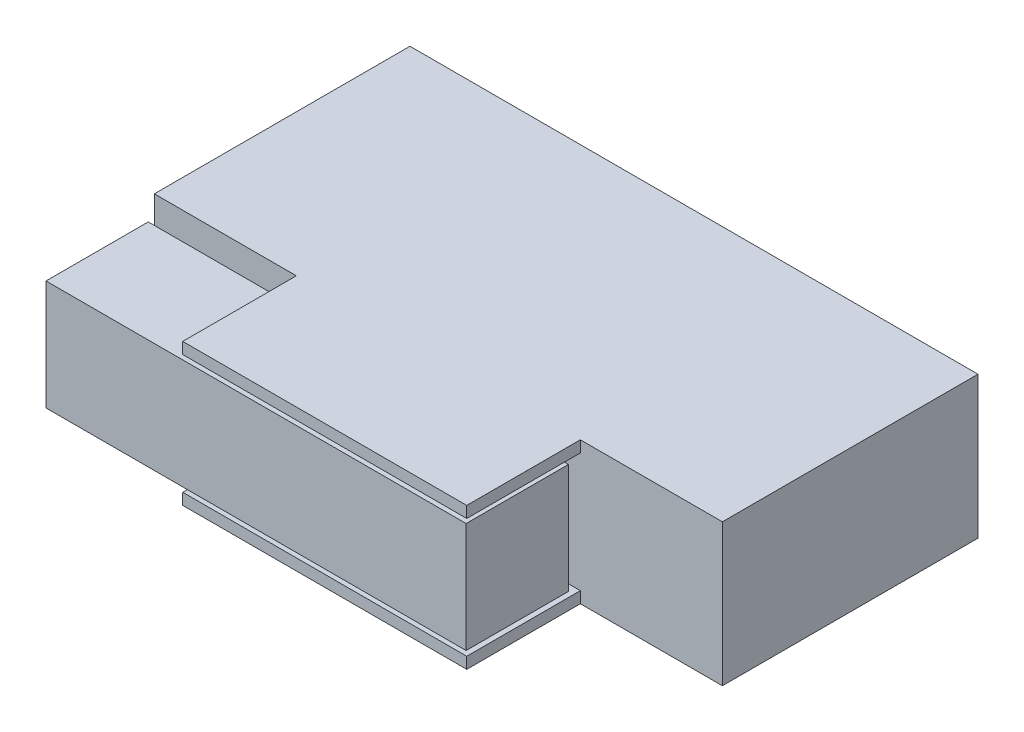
ISO-10303-21;
HEADER;
FILE_DESCRIPTION(('STEP AP214'),'2;1');
FILE_NAME('part.step','',(''),(''),'','','');
FILE_SCHEMA(('AUTOMOTIVE_DESIGN { 1 0 10303 214 1 1 1 1 }'));
ENDSEC;
DATA;
#1=APPLICATION_CONTEXT('core data for automotive mechanical design processes');
#2=APPLICATION_PROTOCOL_DEFINITION('international standard','automotive_design',2000,#1);
#3=PRODUCT_CONTEXT('',#1,'mechanical');
#4=PRODUCT('Part','Part','',(#3));
#5=PRODUCT_RELATED_PRODUCT_CATEGORY('part','',(#4));
#6=PRODUCT_DEFINITION_FORMATION('','',#4);
#7=PRODUCT_DEFINITION_CONTEXT('part definition',#1,'design');
#8=PRODUCT_DEFINITION('design','',#6,#7);
#9=PRODUCT_DEFINITION_SHAPE('','',#8);
#10=(LENGTH_UNIT() NAMED_UNIT(*) SI_UNIT(.MILLI.,.METRE.));
#11=(NAMED_UNIT(*) PLANE_ANGLE_UNIT() SI_UNIT($,.RADIAN.));
#12=(NAMED_UNIT(*) SI_UNIT($,.STERADIAN.) SOLID_ANGLE_UNIT());
#13=UNCERTAINTY_MEASURE_WITH_UNIT(LENGTH_MEASURE(1.E-05),#10,'distance_accuracy_value','');
#14=(GEOMETRIC_REPRESENTATION_CONTEXT(3) GLOBAL_UNCERTAINTY_ASSIGNED_CONTEXT((#13)) GLOBAL_UNIT_ASSIGNED_CONTEXT((#10,
#11,#12)) REPRESENTATION_CONTEXT('',''));
#15=CARTESIAN_POINT('',(0.,0.,0.));
#16=DIRECTION('',(0.,0.,1.));
#17=DIRECTION('',(1.,0.,0.));
#18=AXIS2_PLACEMENT_3D('',#15,#16,#17);
#19=CARTESIAN_POINT('',(7.4889779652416,2.21823977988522,4.7));
#20=DIRECTION('',(1.,0.,0.));
#21=DIRECTION('',(0.,0.,-1.));
#22=AXIS2_PLACEMENT_3D('',#19,#20,#21);
#23=PLANE('',#22);
#24=DIRECTION('',(0.,1.,0.));
#25=VECTOR('',#24,1.);
#26=CARTESIAN_POINT('',(7.4889779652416,2.21823977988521,6.5));
#27=LINE('',#26,#25);
#28=CARTESIAN_POINT('',(7.4889779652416,0.281760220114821,6.5));
#29=VERTEX_POINT('',#28);
#30=CARTESIAN_POINT('',(7.4889779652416,2.21823977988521,6.5));
#31=VERTEX_POINT('',#30);
#32=EDGE_CURVE('E108',#29,#31,#27,.T.);
#33=ORIENTED_EDGE('',*,*,#32,.F.);
#34=DIRECTION('',(0.,0.,1.));
#35=VECTOR('',#34,1.);
#36=CARTESIAN_POINT('',(7.4889779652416,0.281760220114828,4.69999999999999));
#37=LINE('',#36,#35);
#38=CARTESIAN_POINT('',(7.4889779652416,0.281760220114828,4.69999999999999));
#39=VERTEX_POINT('',#38);
#40=EDGE_CURVE('E12',#39,#29,#37,.T.);
#41=ORIENTED_EDGE('',*,*,#40,.F.);
#42=DIRECTION('',(0.,1.,0.));
#43=VECTOR('',#42,1.);
#44=CARTESIAN_POINT('',(7.4889779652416,2.21823977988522,4.7));
#45=LINE('',#44,#43);
#46=CARTESIAN_POINT('',(7.4889779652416,2.21823977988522,4.7));
#47=VERTEX_POINT('',#46);
#48=EDGE_CURVE('E102',#39,#47,#45,.T.);
#49=ORIENTED_EDGE('',*,*,#48,.T.);
#50=DIRECTION('',(0.,0.,1.));
#51=VECTOR('',#50,1.);
#52=CARTESIAN_POINT('',(7.4889779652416,2.21823977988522,4.7));
#53=LINE('',#52,#51);
#54=EDGE_CURVE('E47',#47,#31,#53,.T.);
#55=ORIENTED_EDGE('',*,*,#54,.T.);
#56=EDGE_LOOP('',(#33,#41,#49,#55));
#57=FACE_BOUND('',#56,.T.);
#58=ADVANCED_FACE('F44',(#57),#23,.T.);
#59=CARTESIAN_POINT('',(7.4889779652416,0.281760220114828,4.69999999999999));
#60=DIRECTION('',(0.,-1.,0.));
#61=DIRECTION('',(0.,0.,-1.));
#62=AXIS2_PLACEMENT_3D('',#59,#60,#61);
#63=PLANE('',#62);
#64=DIRECTION('',(1.,0.,0.));
#65=VECTOR('',#64,1.);
#66=CARTESIAN_POINT('',(7.4889779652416,0.281760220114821,6.5));
#67=LINE('',#66,#65);
#68=CARTESIAN_POINT('',(0.0931577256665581,0.281760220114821,6.5));
#69=VERTEX_POINT('',#68);
#70=EDGE_CURVE('E104',#69,#29,#67,.T.);
#71=ORIENTED_EDGE('',*,*,#70,.F.);
#72=DIRECTION('',(0.,0.,1.));
#73=VECTOR('',#72,1.);
#74=CARTESIAN_POINT('',(0.0931577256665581,0.281760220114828,4.69999999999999));
#75=LINE('',#74,#73);
#76=CARTESIAN_POINT('',(0.0931577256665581,0.281760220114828,4.69999999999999));
#77=VERTEX_POINT('',#76);
#78=EDGE_CURVE('E53',#77,#69,#75,.T.);
#79=ORIENTED_EDGE('',*,*,#78,.F.);
#80=DIRECTION('',(1.,0.,0.));
#81=VECTOR('',#80,1.);
#82=CARTESIAN_POINT('',(7.4889779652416,0.281760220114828,4.69999999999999));
#83=LINE('',#82,#81);
#84=EDGE_CURVE('E99',#77,#39,#83,.T.);
#85=ORIENTED_EDGE('',*,*,#84,.T.);
#86=ORIENTED_EDGE('',*,*,#40,.T.);
#87=EDGE_LOOP('',(#71,#79,#85,#86));
#88=FACE_BOUND('',#87,.T.);
#89=ADVANCED_FACE('F118',(#88),#63,.T.);
#90=CARTESIAN_POINT('',(0.0931577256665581,2.21823977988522,4.7));
#91=DIRECTION('',(-1.,0.,0.));
#92=DIRECTION('',(0.,0.,1.));
#93=AXIS2_PLACEMENT_3D('',#90,#91,#92);
#94=PLANE('',#93);
#95=DIRECTION('',(0.,-1.,0.));
#96=VECTOR('',#95,1.);
#97=CARTESIAN_POINT('',(0.0931577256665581,2.21823977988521,6.5));
#98=LINE('',#97,#96);
#99=CARTESIAN_POINT('',(0.0931577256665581,2.21823977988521,6.5));
#100=VERTEX_POINT('',#99);
#101=EDGE_CURVE('E94',#100,#69,#98,.T.);
#102=ORIENTED_EDGE('',*,*,#101,.F.);
#103=DIRECTION('',(0.,0.,1.));
#104=VECTOR('',#103,1.);
#105=CARTESIAN_POINT('',(0.0931577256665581,2.21823977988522,4.7));
#106=LINE('',#105,#104);
#107=CARTESIAN_POINT('',(0.0931577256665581,2.21823977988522,4.7));
#108=VERTEX_POINT('',#107);
#109=EDGE_CURVE('E89',#108,#100,#106,.T.);
#110=ORIENTED_EDGE('',*,*,#109,.F.);
#111=DIRECTION('',(0.,-1.,0.));
#112=VECTOR('',#111,1.);
#113=CARTESIAN_POINT('',(0.0931577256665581,2.21823977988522,4.7));
#114=LINE('',#113,#112);
#115=EDGE_CURVE('E92',#108,#77,#114,.T.);
#116=ORIENTED_EDGE('',*,*,#115,.T.);
#117=ORIENTED_EDGE('',*,*,#78,.T.);
#118=EDGE_LOOP('',(#102,#110,#116,#117));
#119=FACE_BOUND('',#118,.T.);
#120=ADVANCED_FACE('F91',(#119),#94,.T.);
#121=CARTESIAN_POINT('',(7.4889779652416,2.21823977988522,4.7));
#122=DIRECTION('',(0.,1.,0.));
#123=DIRECTION('',(0.,0.,1.));
#124=AXIS2_PLACEMENT_3D('',#121,#122,#123);
#125=PLANE('',#124);
#126=DIRECTION('',(-1.,0.,0.));
#127=VECTOR('',#126,1.);
#128=CARTESIAN_POINT('',(7.4889779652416,2.21823977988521,6.5));
#129=LINE('',#128,#127);
#130=EDGE_CURVE('E111',#31,#100,#129,.T.);
#131=ORIENTED_EDGE('',*,*,#130,.F.);
#132=ORIENTED_EDGE('',*,*,#54,.F.);
#133=DIRECTION('',(-1.,0.,0.));
#134=VECTOR('',#133,1.);
#135=CARTESIAN_POINT('',(7.4889779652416,2.21823977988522,4.7));
#136=LINE('',#135,#134);
#137=EDGE_CURVE('E98',#47,#108,#136,.T.);
#138=ORIENTED_EDGE('',*,*,#137,.T.);
#139=ORIENTED_EDGE('',*,*,#109,.T.);
#140=EDGE_LOOP('',(#131,#132,#138,#139));
#141=FACE_BOUND('',#140,.T.);
#142=ADVANCED_FACE('F101',(#141),#125,.T.);
#143=CARTESIAN_POINT('',(7.4889779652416,0.281760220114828,4.69999999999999));
#144=DIRECTION('',(0.,0.,-1.));
#145=DIRECTION('',(-1.,0.,0.));
#146=AXIS2_PLACEMENT_3D('',#143,#144,#145);
#147=PLANE('',#146);
#148=ORIENTED_EDGE('',*,*,#48,.F.);
#149=ORIENTED_EDGE('',*,*,#84,.F.);
#150=ORIENTED_EDGE('',*,*,#115,.F.);
#151=ORIENTED_EDGE('',*,*,#137,.F.);
#152=EDGE_LOOP('',(#148,#149,#150,#151));
#153=FACE_BOUND('',#152,.T.);
#154=ADVANCED_FACE('F97',(#153),#147,.T.);
#155=CARTESIAN_POINT('',(7.4889779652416,0.281760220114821,6.5));
#156=DIRECTION('',(0.,0.,-1.));
#157=DIRECTION('',(-1.,0.,0.));
#158=AXIS2_PLACEMENT_3D('',#155,#156,#157);
#159=PLANE('',#158);
#160=ORIENTED_EDGE('',*,*,#32,.T.);
#161=ORIENTED_EDGE('',*,*,#130,.T.);
#162=ORIENTED_EDGE('',*,*,#101,.T.);
#163=ORIENTED_EDGE('',*,*,#70,.T.);
#164=EDGE_LOOP('',(#160,#161,#162,#163));
#165=FACE_BOUND('',#164,.T.);
#166=ADVANCED_FACE('F117',(#165),#159,.F.);
#167=CLOSED_SHELL('',(#58,#89,#120,#142,#154,#166));
#168=MANIFOLD_SOLID_BREP('B2',#167);
#169=CARTESIAN_POINT('',(0.,2.49999999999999,6.5));
#170=DIRECTION('',(0.,0.,-1.));
#171=DIRECTION('',(-1.,0.,0.));
#172=AXIS2_PLACEMENT_3D('',#169,#170,#171);
#173=PLANE('',#172);
#174=DIRECTION('',(1.,0.,0.));
#175=VECTOR('',#174,1.);
#176=CARTESIAN_POINT('',(0.,0.,6.5));
#177=LINE('',#176,#175);
#178=CARTESIAN_POINT('',(2.5,0.,6.5));
#179=VERTEX_POINT('',#178);
#180=CARTESIAN_POINT('',(7.5,0.,6.5));
#181=VERTEX_POINT('',#180);
#182=EDGE_CURVE('E338',#179,#181,#177,.T.);
#183=ORIENTED_EDGE('',*,*,#182,.T.);
#184=DIRECTION('',(0.,-1.,0.));
#185=VECTOR('',#184,1.);
#186=CARTESIAN_POINT('',(7.5,0.199999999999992,6.5));
#187=LINE('',#186,#185);
#188=CARTESIAN_POINT('',(7.5,0.199999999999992,6.5));
#189=VERTEX_POINT('',#188);
#190=EDGE_CURVE('E266',#189,#181,#187,.T.);
#191=ORIENTED_EDGE('',*,*,#190,.F.);
#192=DIRECTION('',(1.,0.,0.));
#193=VECTOR('',#192,1.);
#194=CARTESIAN_POINT('',(2.5,0.199999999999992,6.5));
#195=LINE('',#194,#193);
#196=CARTESIAN_POINT('',(2.5,0.199999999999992,6.5));
#197=VERTEX_POINT('',#196);
#198=EDGE_CURVE('E279',#197,#189,#195,.T.);
#199=ORIENTED_EDGE('',*,*,#198,.F.);
#200=DIRECTION('',(0.,1.,0.));
#201=VECTOR('',#200,1.);
#202=CARTESIAN_POINT('',(2.5,0.,6.5));
#203=LINE('',#202,#201);
#204=EDGE_CURVE('E318',#179,#197,#203,.T.);
#205=ORIENTED_EDGE('',*,*,#204,.F.);
#206=EDGE_LOOP('',(#183,#191,#199,#205));
#207=FACE_BOUND('',#206,.T.);
#208=ADVANCED_FACE('F169',(#207),#173,.F.);
#209=CARTESIAN_POINT('',(0.,0.,6.5));
#210=DIRECTION('',(1.,0.,0.));
#211=DIRECTION('',(0.,0.,-1.));
#212=AXIS2_PLACEMENT_3D('',#209,#210,#211);
#213=PLANE('',#212);
#214=DIRECTION('',(0.,0.,-1.));
#215=VECTOR('',#214,1.);
#216=CARTESIAN_POINT('',(0.,0.,6.5));
#217=LINE('',#216,#215);
#218=CARTESIAN_POINT('',(0.,0.,4.5));
#219=VERTEX_POINT('',#218);
#220=CARTESIAN_POINT('',(0.,0.,0.));
#221=VERTEX_POINT('',#220);
#222=EDGE_CURVE('E42',#219,#221,#217,.T.);
#223=ORIENTED_EDGE('',*,*,#222,.F.);
#224=DIRECTION('',(0.,-1.,0.));
#225=VECTOR('',#224,1.);
#226=CARTESIAN_POINT('',(0.,2.5,4.5));
#227=LINE('',#226,#225);
#228=CARTESIAN_POINT('',(0.,2.5,4.5));
#229=VERTEX_POINT('',#228);
#230=EDGE_CURVE('E302',#229,#219,#227,.T.);
#231=ORIENTED_EDGE('',*,*,#230,.F.);
#232=DIRECTION('',(0.,0.,-1.));
#233=VECTOR('',#232,1.);
#234=CARTESIAN_POINT('',(0.,2.49999999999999,6.5));
#235=LINE('',#234,#233);
#236=CARTESIAN_POINT('',(0.,2.5,0.));
#237=VERTEX_POINT('',#236);
#238=EDGE_CURVE('E192',#229,#237,#235,.T.);
#239=ORIENTED_EDGE('',*,*,#238,.T.);
#240=DIRECTION('',(0.,-1.,0.));
#241=VECTOR('',#240,1.);
#242=CARTESIAN_POINT('',(0.,0.,0.));
#243=LINE('',#242,#241);
#244=EDGE_CURVE('E325',#237,#221,#243,.T.);
#245=ORIENTED_EDGE('',*,*,#244,.T.);
#246=EDGE_LOOP('',(#223,#231,#239,#245));
#247=FACE_BOUND('',#246,.T.);
#248=ADVANCED_FACE('F171',(#247),#213,.F.);
#249=CARTESIAN_POINT('',(0.,0.,6.5));
#250=DIRECTION('',(0.,1.,0.));
#251=DIRECTION('',(0.,0.,1.));
#252=AXIS2_PLACEMENT_3D('',#249,#250,#251);
#253=PLANE('',#252);
#254=DIRECTION('',(1.,0.,0.));
#255=VECTOR('',#254,1.);
#256=CARTESIAN_POINT('',(10.,0.,4.5));
#257=LINE('',#256,#255);
#258=CARTESIAN_POINT('',(7.5,0.,4.5));
#259=VERTEX_POINT('',#258);
#260=CARTESIAN_POINT('',(10.,0.,4.5));
#261=VERTEX_POINT('',#260);
#262=EDGE_CURVE('E275',#259,#261,#257,.T.);
#263=ORIENTED_EDGE('',*,*,#262,.F.);
#264=DIRECTION('',(0.,0.,1.));
#265=VECTOR('',#264,1.);
#266=CARTESIAN_POINT('',(7.5,0.,4.5));
#267=LINE('',#266,#265);
#268=EDGE_CURVE('E260',#259,#181,#267,.T.);
#269=ORIENTED_EDGE('',*,*,#268,.T.);
#270=ORIENTED_EDGE('',*,*,#182,.F.);
#271=DIRECTION('',(0.,0.,1.));
#272=VECTOR('',#271,1.);
#273=CARTESIAN_POINT('',(2.5,0.,4.5));
#274=LINE('',#273,#272);
#275=CARTESIAN_POINT('',(2.5,0.,4.5));
#276=VERTEX_POINT('',#275);
#277=EDGE_CURVE('E328',#276,#179,#274,.T.);
#278=ORIENTED_EDGE('',*,*,#277,.F.);
#279=DIRECTION('',(1.,0.,0.));
#280=VECTOR('',#279,1.);
#281=CARTESIAN_POINT('',(0.,0.,4.5));
#282=LINE('',#281,#280);
#283=EDGE_CURVE('E304',#219,#276,#282,.T.);
#284=ORIENTED_EDGE('',*,*,#283,.F.);
#285=ORIENTED_EDGE('',*,*,#222,.T.);
#286=DIRECTION('',(1.,0.,0.));
#287=VECTOR('',#286,1.);
#288=CARTESIAN_POINT('',(0.,0.,0.));
#289=LINE('',#288,#287);
#290=CARTESIAN_POINT('',(10.,0.,0.));
#291=VERTEX_POINT('',#290);
#292=EDGE_CURVE('E345',#221,#291,#289,.T.);
#293=ORIENTED_EDGE('',*,*,#292,.T.);
#294=DIRECTION('',(0.,0.,-1.));
#295=VECTOR('',#294,1.);
#296=CARTESIAN_POINT('',(10.,0.,6.5));
#297=LINE('',#296,#295);
#298=EDGE_CURVE('E177',#261,#291,#297,.T.);
#299=ORIENTED_EDGE('',*,*,#298,.F.);
#300=EDGE_LOOP('',(#263,#269,#270,#278,#284,#285,#293,#299));
#301=FACE_BOUND('',#300,.T.);
#302=ADVANCED_FACE('F282',(#301),#253,.F.);
#303=CARTESIAN_POINT('',(10.,0.,6.5));
#304=DIRECTION('',(-1.,0.,0.));
#305=DIRECTION('',(0.,0.,1.));
#306=AXIS2_PLACEMENT_3D('',#303,#304,#305);
#307=PLANE('',#306);
#308=DIRECTION('',(0.,0.,-1.));
#309=VECTOR('',#308,1.);
#310=CARTESIAN_POINT('',(10.,2.5,6.5));
#311=LINE('',#310,#309);
#312=CARTESIAN_POINT('',(10.,2.5,4.5));
#313=VERTEX_POINT('',#312);
#314=CARTESIAN_POINT('',(10.,2.50000000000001,0.));
#315=VERTEX_POINT('',#314);
#316=EDGE_CURVE('E352',#313,#315,#311,.T.);
#317=ORIENTED_EDGE('',*,*,#316,.F.);
#318=DIRECTION('',(0.,1.,0.));
#319=VECTOR('',#318,1.);
#320=CARTESIAN_POINT('',(10.,2.5,4.5));
#321=LINE('',#320,#319);
#322=EDGE_CURVE('E284',#261,#313,#321,.T.);
#323=ORIENTED_EDGE('',*,*,#322,.F.);
#324=ORIENTED_EDGE('',*,*,#298,.T.);
#325=DIRECTION('',(0.,1.,0.));
#326=VECTOR('',#325,1.);
#327=CARTESIAN_POINT('',(10.,0.,0.));
#328=LINE('',#327,#326);
#329=EDGE_CURVE('E347',#291,#315,#328,.T.);
#330=ORIENTED_EDGE('',*,*,#329,.T.);
#331=EDGE_LOOP('',(#317,#323,#324,#330));
#332=FACE_BOUND('',#331,.T.);
#333=ADVANCED_FACE('F355',(#332),#307,.F.);
#334=CARTESIAN_POINT('',(0.,2.49999999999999,6.5));
#335=DIRECTION('',(0.,-1.,0.));
#336=DIRECTION('',(0.,0.,-1.));
#337=AXIS2_PLACEMENT_3D('',#334,#335,#336);
#338=PLANE('',#337);
#339=DIRECTION('',(-1.,0.,0.));
#340=VECTOR('',#339,1.);
#341=CARTESIAN_POINT('',(2.5,2.49999999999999,4.5));
#342=LINE('',#341,#340);
#343=CARTESIAN_POINT('',(2.5,2.49999999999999,4.5));
#344=VERTEX_POINT('',#343);
#345=EDGE_CURVE('E300',#344,#229,#342,.T.);
#346=ORIENTED_EDGE('',*,*,#345,.F.);
#347=DIRECTION('',(0.,0.,1.));
#348=VECTOR('',#347,1.);
#349=CARTESIAN_POINT('',(2.5,2.49999999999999,4.5));
#350=LINE('',#349,#348);
#351=CARTESIAN_POINT('',(2.5,2.49999999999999,6.5));
#352=VERTEX_POINT('',#351);
#353=EDGE_CURVE('E330',#344,#352,#350,.T.);
#354=ORIENTED_EDGE('',*,*,#353,.T.);
#355=DIRECTION('',(-1.,0.,0.));
#356=VECTOR('',#355,1.);
#357=CARTESIAN_POINT('',(0.,2.49999999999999,6.5));
#358=LINE('',#357,#356);
#359=CARTESIAN_POINT('',(7.5,2.49999999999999,6.5));
#360=VERTEX_POINT('',#359);
#361=EDGE_CURVE('E340',#360,#352,#358,.T.);
#362=ORIENTED_EDGE('',*,*,#361,.F.);
#363=DIRECTION('',(0.,0.,1.));
#364=VECTOR('',#363,1.);
#365=CARTESIAN_POINT('',(7.5,2.49999999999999,4.5));
#366=LINE('',#365,#364);
#367=CARTESIAN_POINT('',(7.5,2.49999999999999,4.5));
#368=VERTEX_POINT('',#367);
#369=EDGE_CURVE('E184',#368,#360,#366,.T.);
#370=ORIENTED_EDGE('',*,*,#369,.F.);
#371=DIRECTION('',(-1.,0.,0.));
#372=VECTOR('',#371,1.);
#373=CARTESIAN_POINT('',(7.5,2.49999999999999,4.5));
#374=LINE('',#373,#372);
#375=EDGE_CURVE('E286',#313,#368,#374,.T.);
#376=ORIENTED_EDGE('',*,*,#375,.F.);
#377=ORIENTED_EDGE('',*,*,#316,.T.);
#378=DIRECTION('',(-1.,0.,0.));
#379=VECTOR('',#378,1.);
#380=CARTESIAN_POINT('',(0.,2.5,0.));
#381=LINE('',#380,#379);
#382=EDGE_CURVE('E341',#315,#237,#381,.T.);
#383=ORIENTED_EDGE('',*,*,#382,.T.);
#384=ORIENTED_EDGE('',*,*,#238,.F.);
#385=EDGE_LOOP('',(#346,#354,#362,#370,#376,#377,#383,#384));
#386=FACE_BOUND('',#385,.T.);
#387=ADVANCED_FACE('F366',(#386),#338,.F.);
#388=ORIENTED_EDGE('',*,*,#361,.T.);
#389=DIRECTION('',(0.,1.,0.));
#390=VECTOR('',#389,1.);
#391=CARTESIAN_POINT('',(2.5,2.29999999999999,6.5));
#392=LINE('',#391,#390);
#393=CARTESIAN_POINT('',(2.5,2.29999999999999,6.5));
#394=VERTEX_POINT('',#393);
#395=EDGE_CURVE('E316',#394,#352,#392,.T.);
#396=ORIENTED_EDGE('',*,*,#395,.F.);
#397=DIRECTION('',(-1.,0.,0.));
#398=VECTOR('',#397,1.);
#399=CARTESIAN_POINT('',(2.5,2.29999999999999,6.5));
#400=LINE('',#399,#398);
#401=CARTESIAN_POINT('',(7.5,2.29999999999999,6.5));
#402=VERTEX_POINT('',#401);
#403=EDGE_CURVE('E313',#402,#394,#400,.T.);
#404=ORIENTED_EDGE('',*,*,#403,.F.);
#405=DIRECTION('',(0.,-1.,0.));
#406=VECTOR('',#405,1.);
#407=CARTESIAN_POINT('',(7.5,2.29999999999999,6.5));
#408=LINE('',#407,#406);
#409=EDGE_CURVE('E311',#360,#402,#408,.T.);
#410=ORIENTED_EDGE('',*,*,#409,.F.);
#411=EDGE_LOOP('',(#388,#396,#404,#410));
#412=FACE_BOUND('',#411,.T.);
#413=ADVANCED_FACE('F379',(#412),#173,.F.);
#414=CARTESIAN_POINT('',(0.,2.5,0.));
#415=DIRECTION('',(0.,0.,-1.));
#416=DIRECTION('',(-1.,0.,0.));
#417=AXIS2_PLACEMENT_3D('',#414,#415,#416);
#418=PLANE('',#417);
#419=ORIENTED_EDGE('',*,*,#244,.F.);
#420=ORIENTED_EDGE('',*,*,#382,.F.);
#421=ORIENTED_EDGE('',*,*,#329,.F.);
#422=ORIENTED_EDGE('',*,*,#292,.F.);
#423=EDGE_LOOP('',(#419,#420,#421,#422));
#424=FACE_BOUND('',#423,.T.);
#425=ADVANCED_FACE('F363',(#424),#418,.T.);
#426=CARTESIAN_POINT('',(7.5,0.199999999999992,4.5));
#427=DIRECTION('',(-1.,0.,0.));
#428=DIRECTION('',(0.,0.,1.));
#429=AXIS2_PLACEMENT_3D('',#426,#427,#428);
#430=PLANE('',#429);
#431=ORIENTED_EDGE('',*,*,#190,.T.);
#432=ORIENTED_EDGE('',*,*,#268,.F.);
#433=DIRECTION('',(0.,-1.,0.));
#434=VECTOR('',#433,1.);
#435=CARTESIAN_POINT('',(7.5,0.199999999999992,4.5));
#436=LINE('',#435,#434);
#437=CARTESIAN_POINT('',(7.5,0.199999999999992,4.5));
#438=VERTEX_POINT('',#437);
#439=EDGE_CURVE('E263',#438,#259,#436,.T.);
#440=ORIENTED_EDGE('',*,*,#439,.F.);
#441=DIRECTION('',(0.,0.,1.));
#442=VECTOR('',#441,1.);
#443=CARTESIAN_POINT('',(7.5,0.199999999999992,4.5));
#444=LINE('',#443,#442);
#445=EDGE_CURVE('E323',#438,#189,#444,.T.);
#446=ORIENTED_EDGE('',*,*,#445,.T.);
#447=EDGE_LOOP('',(#431,#432,#440,#446));
#448=FACE_BOUND('',#447,.T.);
#449=ADVANCED_FACE('F262',(#448),#430,.F.);
#450=CARTESIAN_POINT('',(2.5,0.199999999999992,4.5));
#451=DIRECTION('',(0.,-1.,0.));
#452=DIRECTION('',(0.,0.,-1.));
#453=AXIS2_PLACEMENT_3D('',#450,#451,#452);
#454=PLANE('',#453);
#455=ORIENTED_EDGE('',*,*,#198,.T.);
#456=ORIENTED_EDGE('',*,*,#445,.F.);
#457=DIRECTION('',(1.,0.,0.));
#458=VECTOR('',#457,1.);
#459=CARTESIAN_POINT('',(2.5,0.199999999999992,4.5));
#460=LINE('',#459,#458);
#461=CARTESIAN_POINT('',(2.5,0.199999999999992,4.5));
#462=VERTEX_POINT('',#461);
#463=EDGE_CURVE('E271',#462,#438,#460,.T.);
#464=ORIENTED_EDGE('',*,*,#463,.F.);
#465=DIRECTION('',(0.,0.,1.));
#466=VECTOR('',#465,1.);
#467=CARTESIAN_POINT('',(2.5,0.199999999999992,4.5));
#468=LINE('',#467,#466);
#469=EDGE_CURVE('E326',#462,#197,#468,.T.);
#470=ORIENTED_EDGE('',*,*,#469,.T.);
#471=EDGE_LOOP('',(#455,#456,#464,#470));
#472=FACE_BOUND('',#471,.T.);
#473=ADVANCED_FACE('F400',(#472),#454,.F.);
#474=CARTESIAN_POINT('',(2.5,0.,4.5));
#475=DIRECTION('',(1.,0.,0.));
#476=DIRECTION('',(0.,0.,-1.));
#477=AXIS2_PLACEMENT_3D('',#474,#475,#476);
#478=PLANE('',#477);
#479=ORIENTED_EDGE('',*,*,#204,.T.);
#480=ORIENTED_EDGE('',*,*,#469,.F.);
#481=DIRECTION('',(0.,1.,0.));
#482=VECTOR('',#481,1.);
#483=CARTESIAN_POINT('',(2.5,0.,4.5));
#484=LINE('',#483,#482);
#485=EDGE_CURVE('E307',#276,#462,#484,.T.);
#486=ORIENTED_EDGE('',*,*,#485,.F.);
#487=ORIENTED_EDGE('',*,*,#277,.T.);
#488=EDGE_LOOP('',(#479,#480,#486,#487));
#489=FACE_BOUND('',#488,.T.);
#490=ADVANCED_FACE('F398',(#489),#478,.F.);
#491=CARTESIAN_POINT('',(2.5,2.29999999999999,4.5));
#492=DIRECTION('',(1.,0.,0.));
#493=DIRECTION('',(0.,1.,0.));
#494=AXIS2_PLACEMENT_3D('',#491,#492,#493);
#495=PLANE('',#494);
#496=ORIENTED_EDGE('',*,*,#395,.T.);
#497=ORIENTED_EDGE('',*,*,#353,.F.);
#498=DIRECTION('',(0.,1.,0.));
#499=VECTOR('',#498,1.);
#500=CARTESIAN_POINT('',(2.5,2.29999999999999,4.5));
#501=LINE('',#500,#499);
#502=CARTESIAN_POINT('',(2.5,2.29999999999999,4.5));
#503=VERTEX_POINT('',#502);
#504=EDGE_CURVE('E297',#503,#344,#501,.T.);
#505=ORIENTED_EDGE('',*,*,#504,.F.);
#506=DIRECTION('',(0.,0.,1.));
#507=VECTOR('',#506,1.);
#508=CARTESIAN_POINT('',(2.5,2.29999999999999,4.5));
#509=LINE('',#508,#507);
#510=EDGE_CURVE('E333',#503,#394,#509,.T.);
#511=ORIENTED_EDGE('',*,*,#510,.T.);
#512=EDGE_LOOP('',(#496,#497,#505,#511));
#513=FACE_BOUND('',#512,.T.);
#514=ADVANCED_FACE('F377',(#513),#495,.F.);
#515=CARTESIAN_POINT('',(2.5,2.29999999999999,4.5));
#516=DIRECTION('',(0.,1.,0.));
#517=DIRECTION('',(0.,0.,1.));
#518=AXIS2_PLACEMENT_3D('',#515,#516,#517);
#519=PLANE('',#518);
#520=ORIENTED_EDGE('',*,*,#403,.T.);
#521=ORIENTED_EDGE('',*,*,#510,.F.);
#522=DIRECTION('',(-1.,0.,0.));
#523=VECTOR('',#522,1.);
#524=CARTESIAN_POINT('',(2.5,2.29999999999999,4.5));
#525=LINE('',#524,#523);
#526=CARTESIAN_POINT('',(7.5,2.29999999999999,4.5));
#527=VERTEX_POINT('',#526);
#528=EDGE_CURVE('E294',#527,#503,#525,.T.);
#529=ORIENTED_EDGE('',*,*,#528,.F.);
#530=DIRECTION('',(0.,0.,1.));
#531=VECTOR('',#530,1.);
#532=CARTESIAN_POINT('',(7.5,2.29999999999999,4.5));
#533=LINE('',#532,#531);
#534=EDGE_CURVE('E335',#527,#402,#533,.T.);
#535=ORIENTED_EDGE('',*,*,#534,.T.);
#536=EDGE_LOOP('',(#520,#521,#529,#535));
#537=FACE_BOUND('',#536,.T.);
#538=ADVANCED_FACE('F373',(#537),#519,.F.);
#539=CARTESIAN_POINT('',(7.5,2.29999999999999,4.5));
#540=DIRECTION('',(-1.,0.,0.));
#541=DIRECTION('',(0.,0.,1.));
#542=AXIS2_PLACEMENT_3D('',#539,#540,#541);
#543=PLANE('',#542);
#544=ORIENTED_EDGE('',*,*,#409,.T.);
#545=ORIENTED_EDGE('',*,*,#534,.F.);
#546=DIRECTION('',(0.,-1.,0.));
#547=VECTOR('',#546,1.);
#548=CARTESIAN_POINT('',(7.5,2.29999999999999,4.5));
#549=LINE('',#548,#547);
#550=EDGE_CURVE('E291',#368,#527,#549,.T.);
#551=ORIENTED_EDGE('',*,*,#550,.F.);
#552=ORIENTED_EDGE('',*,*,#369,.T.);
#553=EDGE_LOOP('',(#544,#545,#551,#552));
#554=FACE_BOUND('',#553,.T.);
#555=ADVANCED_FACE('F370',(#554),#543,.F.);
#556=CARTESIAN_POINT('',(7.5,0.,4.5));
#557=DIRECTION('',(0.,0.,-1.));
#558=DIRECTION('',(-1.,0.,0.));
#559=AXIS2_PLACEMENT_3D('',#556,#557,#558);
#560=PLANE('',#559);
#561=ORIENTED_EDGE('',*,*,#439,.T.);
#562=ORIENTED_EDGE('',*,*,#262,.T.);
#563=ORIENTED_EDGE('',*,*,#322,.T.);
#564=ORIENTED_EDGE('',*,*,#375,.T.);
#565=ORIENTED_EDGE('',*,*,#550,.T.);
#566=ORIENTED_EDGE('',*,*,#528,.T.);
#567=ORIENTED_EDGE('',*,*,#504,.T.);
#568=ORIENTED_EDGE('',*,*,#345,.T.);
#569=ORIENTED_EDGE('',*,*,#230,.T.);
#570=ORIENTED_EDGE('',*,*,#283,.T.);
#571=ORIENTED_EDGE('',*,*,#485,.T.);
#572=ORIENTED_EDGE('',*,*,#463,.T.);
#573=EDGE_LOOP('',(#561,#562,#563,#564,#565,#566,#567,#568,#569,#570,#571,#572));
#574=FACE_BOUND('',#573,.T.);
#575=ADVANCED_FACE('F274',(#574),#560,.F.);
#576=CLOSED_SHELL('',(#208,#248,#302,#333,#387,#413,#425,#449,#473,#490,#514,#538,#555,#575));
#577=MANIFOLD_SOLID_BREP('B6',#576);
#578=ADVANCED_BREP_SHAPE_REPRESENTATION('',(#18,#168,#577),#14);
#579=SHAPE_DEFINITION_REPRESENTATION(#9,#578);
ENDSEC;
END-ISO-10303-21;
